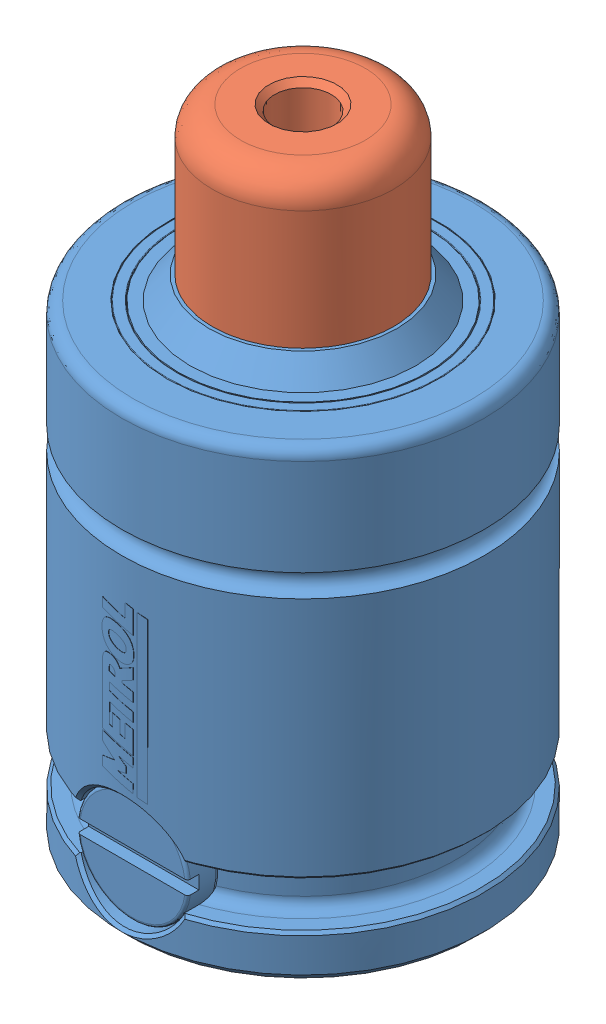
SolidWorks assembly EX0360-013.SLDASM, configuration Default (file format 7000). Lengths in mm.
Overall size (32 56 32.1).
2 component instances, 2 part files, 5 mates.
Components (placement in the parent):
- EX0360 Body-1: EX0360 Body.SLDPRT [EX-360-013] x (0 0 1) z (0 -1 0) size (32.1 32 43)
- EX-360 Piston-1: EX-360 Piston.SLDPRT [EX-360-013] at (0 26 0) x (-0.911289 0 -0.411768) z (0 -1 0) size (24 24 30)
Mates (geometry in assembly coordinates):
- Concentric1: concentric aligned: cylinder of EX0360 Body-1 through (0 0 0) axis (0 -1 0) radius 8; cylinder of EX-360 Piston-1 through (0 26 0) axis (0 -1 0) radius 8
- LimitDistance1: limit distance anti-aligned: plane of EX0360 Body-1 through (0 31 0) normal (0 -1 0); plane of EX-360 Piston-1 through (4.9412 31 -10.9355) normal (0 1 0)
- Coincident1: coincident anti-aligned: plane of EX0360 Body-1 through (0 0 0) normal (0 -1 0); plane of assembly through (0 0 0) normal (0 1 0)
- Coincident2: coincident aligned: plane of EX0360 Body-1; plane of assembly through (0 0 0) normal (0 0 1)
- Coincident3: coincident anti-aligned: plane of EX0360 Body-1; plane of assembly through (0 0 0) normal (1 0 0)
